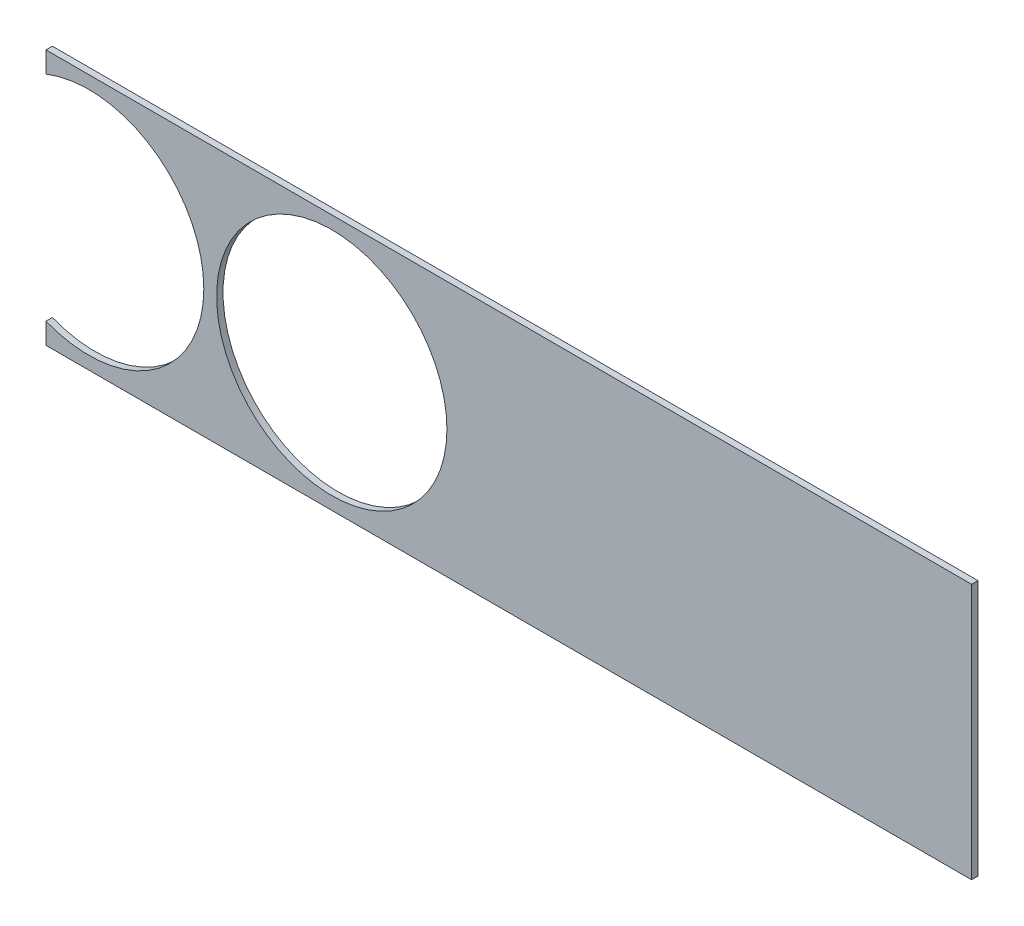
ISO-10303-21;
HEADER;
FILE_DESCRIPTION(('STEP AP214'),'2;1');
FILE_NAME('part.step','',(''),(''),'','','');
FILE_SCHEMA(('AUTOMOTIVE_DESIGN { 1 0 10303 214 1 1 1 1 }'));
ENDSEC;
DATA;
#1=APPLICATION_CONTEXT('core data for automotive mechanical design processes');
#2=APPLICATION_PROTOCOL_DEFINITION('international standard','automotive_design',2000,#1);
#3=PRODUCT_CONTEXT('',#1,'mechanical');
#4=PRODUCT('Part','Part','',(#3));
#5=PRODUCT_RELATED_PRODUCT_CATEGORY('part','',(#4));
#6=PRODUCT_DEFINITION_FORMATION('','',#4);
#7=PRODUCT_DEFINITION_CONTEXT('part definition',#1,'design');
#8=PRODUCT_DEFINITION('design','',#6,#7);
#9=PRODUCT_DEFINITION_SHAPE('','',#8);
#10=(LENGTH_UNIT() NAMED_UNIT(*) SI_UNIT(.MILLI.,.METRE.));
#11=(NAMED_UNIT(*) PLANE_ANGLE_UNIT() SI_UNIT($,.RADIAN.));
#12=(NAMED_UNIT(*) SI_UNIT($,.STERADIAN.) SOLID_ANGLE_UNIT());
#13=UNCERTAINTY_MEASURE_WITH_UNIT(LENGTH_MEASURE(1.E-05),#10,'distance_accuracy_value','');
#14=(GEOMETRIC_REPRESENTATION_CONTEXT(3) GLOBAL_UNCERTAINTY_ASSIGNED_CONTEXT((#13)) GLOBAL_UNIT_ASSIGNED_CONTEXT((#10,
#11,#12)) REPRESENTATION_CONTEXT('',''));
#15=CARTESIAN_POINT('',(0.,0.,0.));
#16=DIRECTION('',(0.,0.,1.));
#17=DIRECTION('',(1.,0.,0.));
#18=AXIS2_PLACEMENT_3D('',#15,#16,#17);
#19=CARTESIAN_POINT('',(-57.,0.,1.5));
#20=DIRECTION('',(0.,0.,1.));
#21=DIRECTION('',(1.,0.,0.));
#22=AXIS2_PLACEMENT_3D('',#19,#20,#21);
#23=PLANE('',#22);
#24=DIRECTION('',(0.,-1.,0.));
#25=VECTOR('',#24,1.);
#26=CARTESIAN_POINT('',(-67.,30.,1.5));
#27=LINE('',#26,#25);
#28=CARTESIAN_POINT('',(-67.,30.,1.5));
#29=VERTEX_POINT('',#28);
#30=CARTESIAN_POINT('',(-67.,25.0798724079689,1.5));
#31=VERTEX_POINT('',#30);
#32=EDGE_CURVE('E132',#29,#31,#27,.T.);
#33=ORIENTED_EDGE('',*,*,#32,.T.);
#34=CARTESIAN_POINT('',(-57.,0.,1.5));
#35=DIRECTION('',(0.,0.,-1.));
#36=DIRECTION('',(1.,0.,0.));
#37=AXIS2_PLACEMENT_3D('',#34,#35,#36);
#38=CIRCLE('',#37,27.);
#39=CARTESIAN_POINT('',(-67.,-25.0798724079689,1.5));
#40=VERTEX_POINT('',#39);
#41=EDGE_CURVE('E90',#31,#40,#38,.T.);
#42=ORIENTED_EDGE('',*,*,#41,.T.);
#43=DIRECTION('',(0.,-1.,0.));
#44=VECTOR('',#43,1.);
#45=CARTESIAN_POINT('',(-67.,-25.0798724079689,1.5));
#46=LINE('',#45,#44);
#47=CARTESIAN_POINT('',(-67.,-30.,1.5));
#48=VERTEX_POINT('',#47);
#49=EDGE_CURVE('E103',#40,#48,#46,.T.);
#50=ORIENTED_EDGE('',*,*,#49,.T.);
#51=DIRECTION('',(1.,0.,0.));
#52=VECTOR('',#51,1.);
#53=CARTESIAN_POINT('',(-67.,-30.,1.5));
#54=LINE('',#53,#52);
#55=CARTESIAN_POINT('',(150.,-30.,1.5));
#56=VERTEX_POINT('',#55);
#57=EDGE_CURVE('E97',#48,#56,#54,.T.);
#58=ORIENTED_EDGE('',*,*,#57,.T.);
#59=DIRECTION('',(0.,1.,0.));
#60=VECTOR('',#59,1.);
#61=CARTESIAN_POINT('',(150.,30.,1.5));
#62=LINE('',#61,#60);
#63=CARTESIAN_POINT('',(150.,30.,1.5));
#64=VERTEX_POINT('',#63);
#65=EDGE_CURVE('E101',#56,#64,#62,.T.);
#66=ORIENTED_EDGE('',*,*,#65,.T.);
#67=DIRECTION('',(-1.,0.,0.));
#68=VECTOR('',#67,1.);
#69=CARTESIAN_POINT('',(-67.,30.,1.5));
#70=LINE('',#69,#68);
#71=EDGE_CURVE('E53',#64,#29,#70,.T.);
#72=ORIENTED_EDGE('',*,*,#71,.T.);
#73=EDGE_LOOP('',(#33,#42,#50,#58,#66,#72));
#74=FACE_BOUND('',#73,.T.);
#75=CARTESIAN_POINT('',(0.,0.,1.5));
#76=DIRECTION('',(0.,0.,1.));
#77=DIRECTION('',(1.,0.,0.));
#78=AXIS2_PLACEMENT_3D('',#75,#76,#77);
#79=CIRCLE('',#78,27.);
#80=CARTESIAN_POINT('',(27.,0.,1.5));
#81=VERTEX_POINT('',#80);
#82=EDGE_CURVE('E125',#81,#81,#79,.T.);
#83=ORIENTED_EDGE('',*,*,#82,.F.);
#84=EDGE_LOOP('',(#83));
#85=FACE_BOUND('',#84,.T.);
#86=ADVANCED_FACE('F36',(#74,#85),#23,.T.);
#87=CARTESIAN_POINT('',(-57.,0.,0.));
#88=DIRECTION('',(0.,0.,1.));
#89=DIRECTION('',(1.,0.,0.));
#90=AXIS2_PLACEMENT_3D('',#87,#88,#89);
#91=PLANE('',#90);
#92=DIRECTION('',(0.,-1.,0.));
#93=VECTOR('',#92,1.);
#94=CARTESIAN_POINT('',(-67.,30.,0.));
#95=LINE('',#94,#93);
#96=CARTESIAN_POINT('',(-67.,30.,0.));
#97=VERTEX_POINT('',#96);
#98=CARTESIAN_POINT('',(-67.,25.0798724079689,0.));
#99=VERTEX_POINT('',#98);
#100=EDGE_CURVE('E121',#97,#99,#95,.T.);
#101=ORIENTED_EDGE('',*,*,#100,.F.);
#102=DIRECTION('',(-1.,0.,0.));
#103=VECTOR('',#102,1.);
#104=CARTESIAN_POINT('',(-67.,30.,0.));
#105=LINE('',#104,#103);
#106=CARTESIAN_POINT('',(150.,30.,0.));
#107=VERTEX_POINT('',#106);
#108=EDGE_CURVE('E82',#107,#97,#105,.T.);
#109=ORIENTED_EDGE('',*,*,#108,.F.);
#110=DIRECTION('',(0.,1.,0.));
#111=VECTOR('',#110,1.);
#112=CARTESIAN_POINT('',(150.,30.,0.));
#113=LINE('',#112,#111);
#114=CARTESIAN_POINT('',(150.,-30.,0.));
#115=VERTEX_POINT('',#114);
#116=EDGE_CURVE('E76',#115,#107,#113,.T.);
#117=ORIENTED_EDGE('',*,*,#116,.F.);
#118=DIRECTION('',(1.,0.,0.));
#119=VECTOR('',#118,1.);
#120=CARTESIAN_POINT('',(-67.,-30.,0.));
#121=LINE('',#120,#119);
#122=CARTESIAN_POINT('',(-67.,-30.,0.));
#123=VERTEX_POINT('',#122);
#124=EDGE_CURVE('E111',#123,#115,#121,.T.);
#125=ORIENTED_EDGE('',*,*,#124,.F.);
#126=DIRECTION('',(0.,-1.,0.));
#127=VECTOR('',#126,1.);
#128=CARTESIAN_POINT('',(-67.,-25.0798724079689,0.));
#129=LINE('',#128,#127);
#130=CARTESIAN_POINT('',(-67.,-25.0798724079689,0.));
#131=VERTEX_POINT('',#130);
#132=EDGE_CURVE('E127',#131,#123,#129,.T.);
#133=ORIENTED_EDGE('',*,*,#132,.F.);
#134=CARTESIAN_POINT('',(-57.,0.,0.));
#135=DIRECTION('',(0.,0.,-1.));
#136=DIRECTION('',(1.,0.,0.));
#137=AXIS2_PLACEMENT_3D('',#134,#135,#136);
#138=CIRCLE('',#137,27.);
#139=EDGE_CURVE('E124',#99,#131,#138,.T.);
#140=ORIENTED_EDGE('',*,*,#139,.F.);
#141=EDGE_LOOP('',(#101,#109,#117,#125,#133,#140));
#142=FACE_BOUND('',#141,.T.);
#143=CARTESIAN_POINT('',(0.,0.,0.));
#144=DIRECTION('',(0.,0.,1.));
#145=DIRECTION('',(1.,0.,0.));
#146=AXIS2_PLACEMENT_3D('',#143,#144,#145);
#147=CIRCLE('',#146,27.);
#148=CARTESIAN_POINT('',(27.,0.,0.));
#149=VERTEX_POINT('',#148);
#150=EDGE_CURVE('E261',#149,#149,#147,.T.);
#151=ORIENTED_EDGE('',*,*,#150,.T.);
#152=EDGE_LOOP('',(#151));
#153=FACE_BOUND('',#152,.T.);
#154=ADVANCED_FACE('F141',(#142,#153),#91,.F.);
#155=CARTESIAN_POINT('',(-67.,30.,1.5));
#156=DIRECTION('',(1.,0.,0.));
#157=DIRECTION('',(0.,0.,-1.));
#158=AXIS2_PLACEMENT_3D('',#155,#156,#157);
#159=PLANE('',#158);
#160=ORIENTED_EDGE('',*,*,#100,.T.);
#161=DIRECTION('',(0.,0.,-1.));
#162=VECTOR('',#161,1.);
#163=CARTESIAN_POINT('',(-67.,25.0798724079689,1.5));
#164=LINE('',#163,#162);
#165=EDGE_CURVE('E11',#31,#99,#164,.T.);
#166=ORIENTED_EDGE('',*,*,#165,.F.);
#167=ORIENTED_EDGE('',*,*,#32,.F.);
#168=DIRECTION('',(0.,0.,-1.));
#169=VECTOR('',#168,1.);
#170=CARTESIAN_POINT('',(-67.,30.,1.5));
#171=LINE('',#170,#169);
#172=EDGE_CURVE('E117',#29,#97,#171,.T.);
#173=ORIENTED_EDGE('',*,*,#172,.T.);
#174=EDGE_LOOP('',(#160,#166,#167,#173));
#175=FACE_BOUND('',#174,.T.);
#176=ADVANCED_FACE('F38',(#175),#159,.F.);
#177=CARTESIAN_POINT('',(-57.,0.,1.5));
#178=DIRECTION('',(0.,0.,-1.));
#179=DIRECTION('',(-1.,0.,0.));
#180=AXIS2_PLACEMENT_3D('',#177,#178,#179);
#181=CYLINDRICAL_SURFACE('',#180,27.);
#182=ORIENTED_EDGE('',*,*,#139,.T.);
#183=DIRECTION('',(0.,0.,-1.));
#184=VECTOR('',#183,1.);
#185=CARTESIAN_POINT('',(-67.,-25.0798724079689,1.5));
#186=LINE('',#185,#184);
#187=EDGE_CURVE('E45',#40,#131,#186,.T.);
#188=ORIENTED_EDGE('',*,*,#187,.F.);
#189=ORIENTED_EDGE('',*,*,#41,.F.);
#190=ORIENTED_EDGE('',*,*,#165,.T.);
#191=EDGE_LOOP('',(#182,#188,#189,#190));
#192=FACE_BOUND('',#191,.T.);
#193=ADVANCED_FACE('F166',(#192),#181,.F.);
#194=CARTESIAN_POINT('',(-67.,-25.0798724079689,1.5));
#195=DIRECTION('',(1.,0.,0.));
#196=DIRECTION('',(0.,0.,-1.));
#197=AXIS2_PLACEMENT_3D('',#194,#195,#196);
#198=PLANE('',#197);
#199=ORIENTED_EDGE('',*,*,#132,.T.);
#200=DIRECTION('',(0.,0.,-1.));
#201=VECTOR('',#200,1.);
#202=CARTESIAN_POINT('',(-67.,-30.,1.5));
#203=LINE('',#202,#201);
#204=EDGE_CURVE('E112',#48,#123,#203,.T.);
#205=ORIENTED_EDGE('',*,*,#204,.F.);
#206=ORIENTED_EDGE('',*,*,#49,.F.);
#207=ORIENTED_EDGE('',*,*,#187,.T.);
#208=EDGE_LOOP('',(#199,#205,#206,#207));
#209=FACE_BOUND('',#208,.T.);
#210=ADVANCED_FACE('F138',(#209),#198,.F.);
#211=CARTESIAN_POINT('',(-67.,-30.,1.5));
#212=DIRECTION('',(0.,1.,0.));
#213=DIRECTION('',(-1.,0.,0.));
#214=AXIS2_PLACEMENT_3D('',#211,#212,#213);
#215=PLANE('',#214);
#216=ORIENTED_EDGE('',*,*,#124,.T.);
#217=DIRECTION('',(0.,0.,-1.));
#218=VECTOR('',#217,1.);
#219=CARTESIAN_POINT('',(150.,-30.,1.5));
#220=LINE('',#219,#218);
#221=EDGE_CURVE('E108',#56,#115,#220,.T.);
#222=ORIENTED_EDGE('',*,*,#221,.F.);
#223=ORIENTED_EDGE('',*,*,#57,.F.);
#224=ORIENTED_EDGE('',*,*,#204,.T.);
#225=EDGE_LOOP('',(#216,#222,#223,#224));
#226=FACE_BOUND('',#225,.T.);
#227=ADVANCED_FACE('F109',(#226),#215,.F.);
#228=CARTESIAN_POINT('',(150.,30.,1.5));
#229=DIRECTION('',(-1.,0.,0.));
#230=DIRECTION('',(0.,0.,1.));
#231=AXIS2_PLACEMENT_3D('',#228,#229,#230);
#232=PLANE('',#231);
#233=ORIENTED_EDGE('',*,*,#116,.T.);
#234=DIRECTION('',(0.,0.,-1.));
#235=VECTOR('',#234,1.);
#236=CARTESIAN_POINT('',(150.,30.,1.5));
#237=LINE('',#236,#235);
#238=EDGE_CURVE('E113',#64,#107,#237,.T.);
#239=ORIENTED_EDGE('',*,*,#238,.F.);
#240=ORIENTED_EDGE('',*,*,#65,.F.);
#241=ORIENTED_EDGE('',*,*,#221,.T.);
#242=EDGE_LOOP('',(#233,#239,#240,#241));
#243=FACE_BOUND('',#242,.T.);
#244=ADVANCED_FACE('F115',(#243),#232,.F.);
#245=CARTESIAN_POINT('',(-67.,30.,1.5));
#246=DIRECTION('',(0.,-1.,0.));
#247=DIRECTION('',(1.,0.,0.));
#248=AXIS2_PLACEMENT_3D('',#245,#246,#247);
#249=PLANE('',#248);
#250=ORIENTED_EDGE('',*,*,#108,.T.);
#251=ORIENTED_EDGE('',*,*,#172,.F.);
#252=ORIENTED_EDGE('',*,*,#71,.F.);
#253=ORIENTED_EDGE('',*,*,#238,.T.);
#254=EDGE_LOOP('',(#250,#251,#252,#253));
#255=FACE_BOUND('',#254,.T.);
#256=ADVANCED_FACE('F146',(#255),#249,.F.);
#257=CARTESIAN_POINT('',(0.,0.,1.5));
#258=DIRECTION('',(0.,0.,-1.));
#259=DIRECTION('',(-1.,0.,0.));
#260=AXIS2_PLACEMENT_3D('',#257,#258,#259);
#261=CYLINDRICAL_SURFACE('',#260,27.);
#262=ORIENTED_EDGE('',*,*,#82,.T.);
#263=EDGE_LOOP('',(#262));
#264=FACE_BOUND('',#263,.T.);
#265=ORIENTED_EDGE('',*,*,#150,.F.);
#266=EDGE_LOOP('',(#265));
#267=FACE_BOUND('',#266,.T.);
#268=ADVANCED_FACE('F148',(#264,#267),#261,.F.);
#269=CLOSED_SHELL('',(#86,#154,#176,#193,#210,#227,#244,#256,#268));
#270=MANIFOLD_SOLID_BREP('B2',#269);
#271=ADVANCED_BREP_SHAPE_REPRESENTATION('',(#18,#270),#14);
#272=SHAPE_DEFINITION_REPRESENTATION(#9,#271);
ENDSEC;
END-ISO-10303-21;
